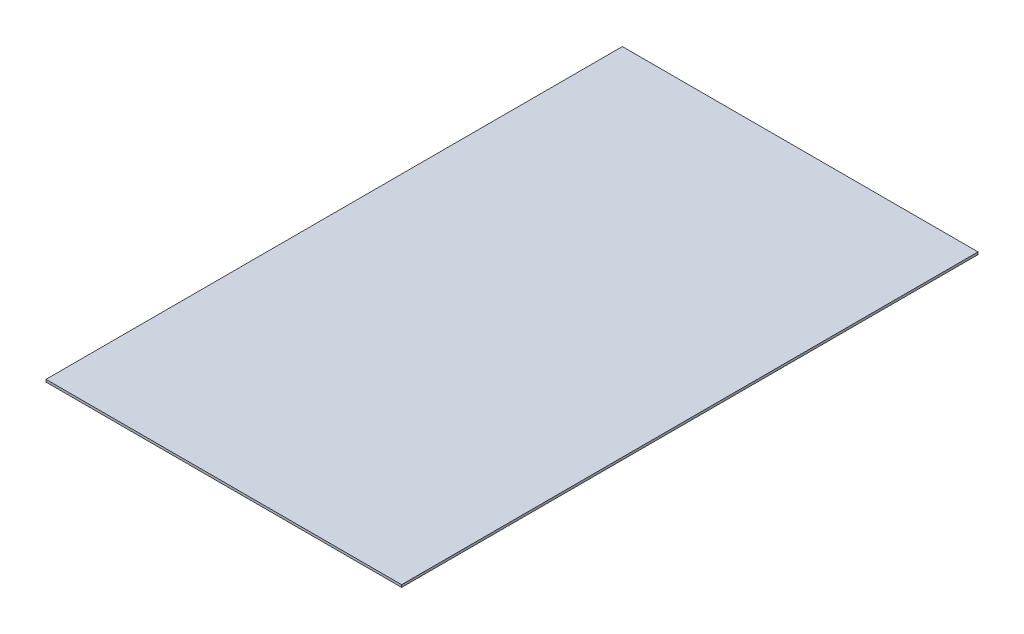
ISO-10303-21;
HEADER;
FILE_DESCRIPTION(('STEP AP214'),'2;1');
FILE_NAME('part.step','',(''),(''),'','','');
FILE_SCHEMA(('AUTOMOTIVE_DESIGN { 1 0 10303 214 1 1 1 1 }'));
ENDSEC;
DATA;
#1=APPLICATION_CONTEXT('core data for automotive mechanical design processes');
#2=APPLICATION_PROTOCOL_DEFINITION('international standard','automotive_design',2000,#1);
#3=PRODUCT_CONTEXT('',#1,'mechanical');
#4=PRODUCT('Part','Part','',(#3));
#5=PRODUCT_RELATED_PRODUCT_CATEGORY('part','',(#4));
#6=PRODUCT_DEFINITION_FORMATION('','',#4);
#7=PRODUCT_DEFINITION_CONTEXT('part definition',#1,'design');
#8=PRODUCT_DEFINITION('design','',#6,#7);
#9=PRODUCT_DEFINITION_SHAPE('','',#8);
#10=(LENGTH_UNIT() NAMED_UNIT(*) SI_UNIT(.MILLI.,.METRE.));
#11=(NAMED_UNIT(*) PLANE_ANGLE_UNIT() SI_UNIT($,.RADIAN.));
#12=(NAMED_UNIT(*) SI_UNIT($,.STERADIAN.) SOLID_ANGLE_UNIT());
#13=UNCERTAINTY_MEASURE_WITH_UNIT(LENGTH_MEASURE(1.E-05),#10,'distance_accuracy_value','');
#14=(GEOMETRIC_REPRESENTATION_CONTEXT(3) GLOBAL_UNCERTAINTY_ASSIGNED_CONTEXT((#13)) GLOBAL_UNIT_ASSIGNED_CONTEXT((#10,
#11,#12)) REPRESENTATION_CONTEXT('',''));
#15=CARTESIAN_POINT('',(0.,0.,0.));
#16=DIRECTION('',(0.,0.,1.));
#17=DIRECTION('',(1.,0.,0.));
#18=AXIS2_PLACEMENT_3D('',#15,#16,#17);
#19=CARTESIAN_POINT('',(0.,10.,0.));
#20=DIRECTION('',(0.,0.,-1.));
#21=DIRECTION('',(-1.,0.,0.));
#22=AXIS2_PLACEMENT_3D('',#19,#20,#21);
#23=PLANE('',#22);
#24=DIRECTION('',(1.,0.,0.));
#25=VECTOR('',#24,1.);
#26=CARTESIAN_POINT('',(0.,0.,0.));
#27=LINE('',#26,#25);
#28=CARTESIAN_POINT('',(0.,0.,0.));
#29=VERTEX_POINT('',#28);
#30=CARTESIAN_POINT('',(1473.2,0.,0.));
#31=VERTEX_POINT('',#30);
#32=EDGE_CURVE('E95',#29,#31,#27,.T.);
#33=ORIENTED_EDGE('',*,*,#32,.T.);
#34=DIRECTION('',(0.,-1.,0.));
#35=VECTOR('',#34,1.);
#36=CARTESIAN_POINT('',(1473.2,10.,0.));
#37=LINE('',#36,#35);
#38=CARTESIAN_POINT('',(1473.2,10.,0.));
#39=VERTEX_POINT('',#38);
#40=EDGE_CURVE('E11',#39,#31,#37,.T.);
#41=ORIENTED_EDGE('',*,*,#40,.F.);
#42=DIRECTION('',(1.,0.,0.));
#43=VECTOR('',#42,1.);
#44=CARTESIAN_POINT('',(0.,10.,0.));
#45=LINE('',#44,#43);
#46=CARTESIAN_POINT('',(0.,10.,0.));
#47=VERTEX_POINT('',#46);
#48=EDGE_CURVE('E83',#47,#39,#45,.T.);
#49=ORIENTED_EDGE('',*,*,#48,.F.);
#50=DIRECTION('',(0.,-1.,0.));
#51=VECTOR('',#50,1.);
#52=CARTESIAN_POINT('',(0.,10.,0.));
#53=LINE('',#52,#51);
#54=EDGE_CURVE('E91',#47,#29,#53,.T.);
#55=ORIENTED_EDGE('',*,*,#54,.T.);
#56=EDGE_LOOP('',(#33,#41,#49,#55));
#57=FACE_BOUND('',#56,.T.);
#58=ADVANCED_FACE('F32',(#57),#23,.F.);
#59=CARTESIAN_POINT('',(1473.2,10.,0.));
#60=DIRECTION('',(-1.,0.,0.));
#61=DIRECTION('',(0.,0.,1.));
#62=AXIS2_PLACEMENT_3D('',#59,#60,#61);
#63=PLANE('',#62);
#64=DIRECTION('',(0.,0.,-1.));
#65=VECTOR('',#64,1.);
#66=CARTESIAN_POINT('',(1473.2,0.,0.));
#67=LINE('',#66,#65);
#68=CARTESIAN_POINT('',(1473.2,0.,-2387.6));
#69=VERTEX_POINT('',#68);
#70=EDGE_CURVE('E87',#31,#69,#67,.T.);
#71=ORIENTED_EDGE('',*,*,#70,.T.);
#72=DIRECTION('',(0.,-1.,0.));
#73=VECTOR('',#72,1.);
#74=CARTESIAN_POINT('',(1473.2,10.,-2387.6));
#75=LINE('',#74,#73);
#76=CARTESIAN_POINT('',(1473.2,10.,-2387.6));
#77=VERTEX_POINT('',#76);
#78=EDGE_CURVE('E40',#77,#69,#75,.T.);
#79=ORIENTED_EDGE('',*,*,#78,.F.);
#80=DIRECTION('',(0.,0.,-1.));
#81=VECTOR('',#80,1.);
#82=CARTESIAN_POINT('',(1473.2,10.,0.));
#83=LINE('',#82,#81);
#84=EDGE_CURVE('E78',#39,#77,#83,.T.);
#85=ORIENTED_EDGE('',*,*,#84,.F.);
#86=ORIENTED_EDGE('',*,*,#40,.T.);
#87=EDGE_LOOP('',(#71,#79,#85,#86));
#88=FACE_BOUND('',#87,.T.);
#89=ADVANCED_FACE('F86',(#88),#63,.F.);
#90=CARTESIAN_POINT('',(0.,10.,-2387.6));
#91=DIRECTION('',(0.,0.,1.));
#92=DIRECTION('',(1.,0.,0.));
#93=AXIS2_PLACEMENT_3D('',#90,#91,#92);
#94=PLANE('',#93);
#95=DIRECTION('',(-1.,0.,0.));
#96=VECTOR('',#95,1.);
#97=CARTESIAN_POINT('',(0.,0.,-2387.6));
#98=LINE('',#97,#96);
#99=CARTESIAN_POINT('',(0.,0.,-2387.6));
#100=VERTEX_POINT('',#99);
#101=EDGE_CURVE('E65',#69,#100,#98,.T.);
#102=ORIENTED_EDGE('',*,*,#101,.T.);
#103=DIRECTION('',(0.,-1.,0.));
#104=VECTOR('',#103,1.);
#105=CARTESIAN_POINT('',(0.,10.,-2387.6));
#106=LINE('',#105,#104);
#107=CARTESIAN_POINT('',(0.,10.,-2387.6));
#108=VERTEX_POINT('',#107);
#109=EDGE_CURVE('E88',#108,#100,#106,.T.);
#110=ORIENTED_EDGE('',*,*,#109,.F.);
#111=DIRECTION('',(-1.,0.,0.));
#112=VECTOR('',#111,1.);
#113=CARTESIAN_POINT('',(0.,10.,-2387.6));
#114=LINE('',#113,#112);
#115=EDGE_CURVE('E81',#77,#108,#114,.T.);
#116=ORIENTED_EDGE('',*,*,#115,.F.);
#117=ORIENTED_EDGE('',*,*,#78,.T.);
#118=EDGE_LOOP('',(#102,#110,#116,#117));
#119=FACE_BOUND('',#118,.T.);
#120=ADVANCED_FACE('F89',(#119),#94,.F.);
#121=CARTESIAN_POINT('',(0.,10.,0.));
#122=DIRECTION('',(1.,0.,0.));
#123=DIRECTION('',(0.,0.,-1.));
#124=AXIS2_PLACEMENT_3D('',#121,#122,#123);
#125=PLANE('',#124);
#126=DIRECTION('',(0.,0.,1.));
#127=VECTOR('',#126,1.);
#128=CARTESIAN_POINT('',(0.,0.,0.));
#129=LINE('',#128,#127);
#130=EDGE_CURVE('E71',#100,#29,#129,.T.);
#131=ORIENTED_EDGE('',*,*,#130,.T.);
#132=ORIENTED_EDGE('',*,*,#54,.F.);
#133=DIRECTION('',(0.,0.,1.));
#134=VECTOR('',#133,1.);
#135=CARTESIAN_POINT('',(0.,10.,0.));
#136=LINE('',#135,#134);
#137=EDGE_CURVE('E48',#108,#47,#136,.T.);
#138=ORIENTED_EDGE('',*,*,#137,.F.);
#139=ORIENTED_EDGE('',*,*,#109,.T.);
#140=EDGE_LOOP('',(#131,#132,#138,#139));
#141=FACE_BOUND('',#140,.T.);
#142=ADVANCED_FACE('F102',(#141),#125,.F.);
#143=CARTESIAN_POINT('',(0.,10.,0.));
#144=DIRECTION('',(0.,1.,0.));
#145=DIRECTION('',(0.,0.,1.));
#146=AXIS2_PLACEMENT_3D('',#143,#144,#145);
#147=PLANE('',#146);
#148=ORIENTED_EDGE('',*,*,#48,.T.);
#149=ORIENTED_EDGE('',*,*,#84,.T.);
#150=ORIENTED_EDGE('',*,*,#115,.T.);
#151=ORIENTED_EDGE('',*,*,#137,.T.);
#152=EDGE_LOOP('',(#148,#149,#150,#151));
#153=FACE_BOUND('',#152,.T.);
#154=ADVANCED_FACE('F79',(#153),#147,.T.);
#155=CARTESIAN_POINT('',(0.,0.,0.));
#156=DIRECTION('',(0.,1.,0.));
#157=DIRECTION('',(0.,0.,1.));
#158=AXIS2_PLACEMENT_3D('',#155,#156,#157);
#159=PLANE('',#158);
#160=ORIENTED_EDGE('',*,*,#32,.F.);
#161=ORIENTED_EDGE('',*,*,#130,.F.);
#162=ORIENTED_EDGE('',*,*,#101,.F.);
#163=ORIENTED_EDGE('',*,*,#70,.F.);
#164=EDGE_LOOP('',(#160,#161,#162,#163));
#165=FACE_BOUND('',#164,.T.);
#166=ADVANCED_FACE('F105',(#165),#159,.F.);
#167=CLOSED_SHELL('',(#58,#89,#120,#142,#154,#166));
#168=MANIFOLD_SOLID_BREP('B2',#167);
#169=ADVANCED_BREP_SHAPE_REPRESENTATION('',(#18,#168),#14);
#170=SHAPE_DEFINITION_REPRESENTATION(#9,#169);
ENDSEC;
END-ISO-10303-21;
